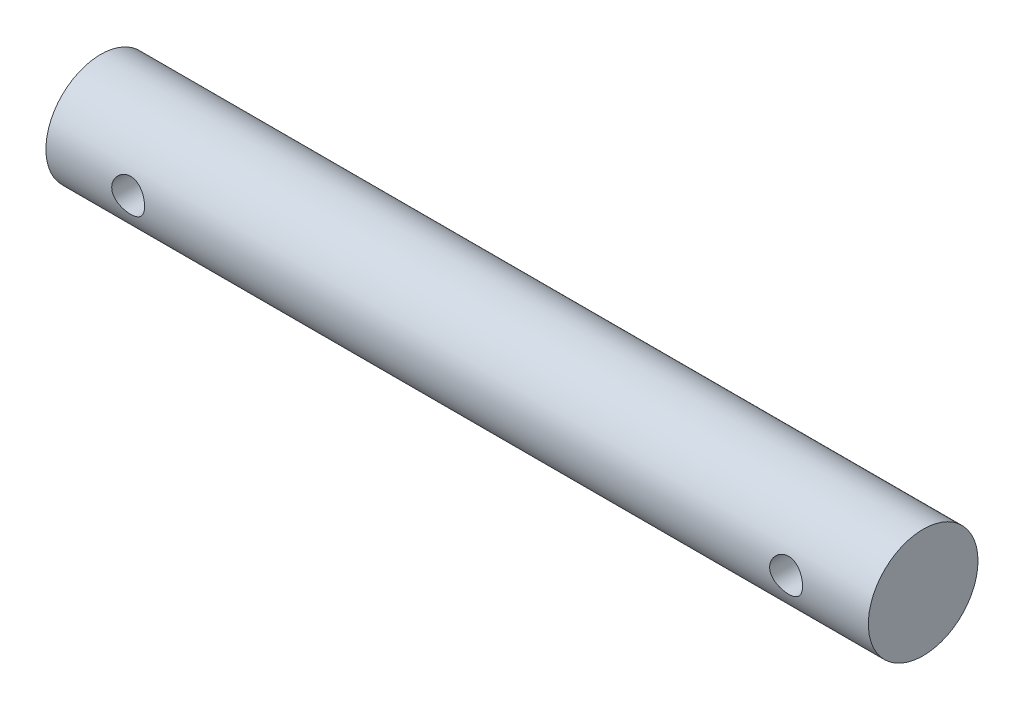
ISO-10303-21;
HEADER;
FILE_DESCRIPTION(('STEP AP214'),'2;1');
FILE_NAME('part.step','',(''),(''),'','','');
FILE_SCHEMA(('AUTOMOTIVE_DESIGN { 1 0 10303 214 1 1 1 1 }'));
ENDSEC;
DATA;
#1=APPLICATION_CONTEXT('core data for automotive mechanical design processes');
#2=APPLICATION_PROTOCOL_DEFINITION('international standard','automotive_design',2000,#1);
#3=PRODUCT_CONTEXT('',#1,'mechanical');
#4=PRODUCT('Part','Part','',(#3));
#5=PRODUCT_RELATED_PRODUCT_CATEGORY('part','',(#4));
#6=PRODUCT_DEFINITION_FORMATION('','',#4);
#7=PRODUCT_DEFINITION_CONTEXT('part definition',#1,'design');
#8=PRODUCT_DEFINITION('design','',#6,#7);
#9=PRODUCT_DEFINITION_SHAPE('','',#8);
#10=(LENGTH_UNIT() NAMED_UNIT(*) SI_UNIT(.MILLI.,.METRE.));
#11=(NAMED_UNIT(*) PLANE_ANGLE_UNIT() SI_UNIT($,.RADIAN.));
#12=(NAMED_UNIT(*) SI_UNIT($,.STERADIAN.) SOLID_ANGLE_UNIT());
#13=UNCERTAINTY_MEASURE_WITH_UNIT(LENGTH_MEASURE(1.E-05),#10,'distance_accuracy_value','');
#14=(GEOMETRIC_REPRESENTATION_CONTEXT(3) GLOBAL_UNCERTAINTY_ASSIGNED_CONTEXT((#13)) GLOBAL_UNIT_ASSIGNED_CONTEXT((#10,
#11,#12)) REPRESENTATION_CONTEXT('',''));
#15=CARTESIAN_POINT('',(0.,0.,0.));
#16=DIRECTION('',(0.,0.,1.));
#17=DIRECTION('',(1.,0.,0.));
#18=AXIS2_PLACEMENT_3D('',#15,#16,#17);
#19=CARTESIAN_POINT('',(150.,0.,0.));
#20=DIRECTION('',(-1.,0.,0.));
#21=DIRECTION('',(0.,0.,1.));
#22=AXIS2_PLACEMENT_3D('',#19,#20,#21);
#23=CYLINDRICAL_SURFACE('',#22,20.);
#24=CARTESIAN_POINT('',(-114.,0.,20.));
#25=CARTESIAN_POINT('',(-113.999989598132,-0.164652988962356,20.0000061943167));
#26=CARTESIAN_POINT('',(-114.006780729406,-0.329207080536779,19.9979626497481));
#27=CARTESIAN_POINT('',(-114.03382200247,-0.657107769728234,19.9898752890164));
#28=CARTESIAN_POINT('',(-114.054072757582,-0.820454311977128,19.983831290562));
#29=CARTESIAN_POINT('',(-114.134886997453,-1.30698999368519,19.959876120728));
#30=CARTESIAN_POINT('',(-114.215512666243,-1.62688975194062,19.9361415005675));
#31=CARTESIAN_POINT('',(-114.374154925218,-2.09209536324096,19.890895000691));
#32=CARTESIAN_POINT('',(-114.433302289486,-2.24469091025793,19.8742101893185));
#33=CARTESIAN_POINT('',(-114.563709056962,-2.5442798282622,19.8380770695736));
#34=CARTESIAN_POINT('',(-114.634964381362,-2.691275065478,19.8186296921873));
#35=CARTESIAN_POINT('',(-114.789092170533,-2.97877080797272,19.7774632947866));
#36=CARTESIAN_POINT('',(-114.871969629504,-3.11926848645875,19.755743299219));
#37=CARTESIAN_POINT('',(-115.048710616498,-3.39282129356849,19.7106054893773));
#38=CARTESIAN_POINT('',(-115.142570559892,-3.52587882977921,19.6871882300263));
#39=CARTESIAN_POINT('',(-115.343279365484,-3.78718937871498,19.6386181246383));
#40=CARTESIAN_POINT('',(-115.450404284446,-3.91522491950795,19.6134358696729));
#41=CARTESIAN_POINT('',(-115.674851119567,-4.16183570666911,19.5625911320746));
#42=CARTESIAN_POINT('',(-115.79216957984,-4.28041413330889,19.5369288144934));
#43=CARTESIAN_POINT('',(-116.036356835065,-4.50747636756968,19.4857950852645));
#44=CARTESIAN_POINT('',(-116.163230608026,-4.615954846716,19.4603237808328));
#45=CARTESIAN_POINT('',(-116.425636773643,-4.82200644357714,19.4102934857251));
#46=CARTESIAN_POINT('',(-116.561165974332,-4.91958354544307,19.3857341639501));
#47=CARTESIAN_POINT('',(-116.843287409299,-5.10532440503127,19.3376596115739));
#48=CARTESIAN_POINT('',(-116.990062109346,-5.19322086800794,19.3141812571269));
#49=CARTESIAN_POINT('',(-117.290805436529,-5.35625892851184,19.2696038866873));
#50=CARTESIAN_POINT('',(-117.444771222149,-5.43140551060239,19.2485039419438));
#51=CARTESIAN_POINT('',(-117.758929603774,-5.56839058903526,19.2093234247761));
#52=CARTESIAN_POINT('',(-117.919123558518,-5.63022616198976,19.1912435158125));
#53=CARTESIAN_POINT('',(-118.244487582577,-5.74000341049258,19.1586962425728));
#54=CARTESIAN_POINT('',(-118.409655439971,-5.78795116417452,19.1442272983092));
#55=CARTESIAN_POINT('',(-118.739174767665,-5.86841419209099,19.1197132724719));
#56=CARTESIAN_POINT('',(-118.903422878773,-5.90131899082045,19.1095570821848));
#57=CARTESIAN_POINT('',(-119.234233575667,-5.95328671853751,19.0934313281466));
#58=CARTESIAN_POINT('',(-119.400795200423,-5.97235522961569,19.0874600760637));
#59=CARTESIAN_POINT('',(-119.735026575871,-5.99648748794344,19.0798925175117));
#60=CARTESIAN_POINT('',(-119.902696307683,-6.0015514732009,19.0782961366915));
#61=CARTESIAN_POINT('',(-120.237852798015,-5.99762541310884,19.0795307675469));
#62=CARTESIAN_POINT('',(-120.405339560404,-5.98863567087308,19.0823616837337));
#63=CARTESIAN_POINT('',(-120.732778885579,-5.95727255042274,19.0921753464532));
#64=CARTESIAN_POINT('',(-120.89278410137,-5.93539727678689,19.0990035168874));
#65=CARTESIAN_POINT('',(-121.210363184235,-5.87886408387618,19.1164806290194));
#66=CARTESIAN_POINT('',(-121.367936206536,-5.84420182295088,19.1271308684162));
#67=CARTESIAN_POINT('',(-121.679475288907,-5.76240333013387,19.151932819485));
#68=CARTESIAN_POINT('',(-121.833442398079,-5.71527077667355,19.166083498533));
#69=CARTESIAN_POINT('',(-122.136866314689,-5.60889138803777,19.197484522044));
#70=CARTESIAN_POINT('',(-122.286321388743,-5.54963996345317,19.2147360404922));
#71=CARTESIAN_POINT('',(-122.581688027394,-5.41860914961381,19.2521004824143));
#72=CARTESIAN_POINT('',(-122.727525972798,-5.34667354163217,19.2722484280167));
#73=CARTESIAN_POINT('',(-123.012672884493,-5.19135839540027,19.3146649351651));
#74=CARTESIAN_POINT('',(-123.151979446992,-5.10797468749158,19.3369342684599));
#75=CARTESIAN_POINT('',(-123.558767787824,-4.84149472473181,19.4060193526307));
#76=CARTESIAN_POINT('',(-123.815349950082,-4.64196639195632,19.4551429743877));
#77=CARTESIAN_POINT('',(-124.302790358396,-4.19522722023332,19.5564461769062));
#78=CARTESIAN_POINT('',(-124.532126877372,-3.94637308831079,19.6086677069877));
#79=CARTESIAN_POINT('',(-124.946203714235,-3.41305957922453,19.708488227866));
#80=CARTESIAN_POINT('',(-125.130941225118,-3.12859796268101,19.7560869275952));
#81=CARTESIAN_POINT('',(-125.451443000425,-2.5294183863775,19.8417268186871));
#82=CARTESIAN_POINT('',(-125.586870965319,-2.21451053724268,19.8797018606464));
#83=CARTESIAN_POINT('',(-125.802397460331,-1.56498212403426,19.9413407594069));
#84=CARTESIAN_POINT('',(-125.882511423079,-1.23036708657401,19.9650086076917));
#85=CARTESIAN_POINT('',(-125.982608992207,-0.563808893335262,19.9947346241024));
#86=CARTESIAN_POINT('',(-126.004646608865,-0.232200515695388,20.001394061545));
#87=CARTESIAN_POINT('',(-125.993723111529,0.429998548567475,19.998116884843));
#88=CARTESIAN_POINT('',(-125.96076933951,0.760589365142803,19.9881824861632));
#89=CARTESIAN_POINT('',(-125.842462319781,1.40361385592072,19.9532280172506));
#90=CARTESIAN_POINT('',(-125.758309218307,1.71628897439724,19.928553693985));
#91=CARTESIAN_POINT('',(-125.541424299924,2.32302067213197,19.8669734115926));
#92=CARTESIAN_POINT('',(-125.408686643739,2.61707500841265,19.8300659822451));
#93=CARTESIAN_POINT('',(-125.094997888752,3.18574067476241,19.7467880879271));
#94=CARTESIAN_POINT('',(-124.913002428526,3.45974481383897,19.7002184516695));
#95=CARTESIAN_POINT('',(-124.507061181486,3.97412373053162,19.6029315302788));
#96=CARTESIAN_POINT('',(-124.283104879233,4.21449005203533,19.5522132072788));
#97=CARTESIAN_POINT('',(-123.915792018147,4.54922702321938,19.4760967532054));
#98=CARTESIAN_POINT('',(-123.78552078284,4.6581855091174,19.45026064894));
#99=CARTESIAN_POINT('',(-123.516101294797,4.8647507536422,19.3996259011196));
#100=CARTESIAN_POINT('',(-123.376956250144,4.96236157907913,19.3748268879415));
#101=CARTESIAN_POINT('',(-123.090620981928,5.14557811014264,19.3269761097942));
#102=CARTESIAN_POINT('',(-122.943427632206,5.23117910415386,19.3039250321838));
#103=CARTESIAN_POINT('',(-122.6420678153,5.38966081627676,19.2602780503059));
#104=CARTESIAN_POINT('',(-122.487904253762,5.46254677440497,19.2396811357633));
#105=CARTESIAN_POINT('',(-122.17427698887,5.59476151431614,19.2016499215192));
#106=CARTESIAN_POINT('',(-122.014838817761,5.65414703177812,19.1842024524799));
#107=CARTESIAN_POINT('',(-121.691232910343,5.75922373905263,19.1529201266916));
#108=CARTESIAN_POINT('',(-121.527067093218,5.80492040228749,19.1390838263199));
#109=CARTESIAN_POINT('',(-121.19517685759,5.88222586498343,19.1154663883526));
#110=CARTESIAN_POINT('',(-121.0274527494,5.91383588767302,19.1056848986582));
#111=CARTESIAN_POINT('',(-120.689728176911,5.96266568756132,19.0905022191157));
#112=CARTESIAN_POINT('',(-120.519727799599,5.97988601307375,19.0851008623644));
#113=CARTESIAN_POINT('',(-120.18594068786,5.99934947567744,19.0789911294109));
#114=CARTESIAN_POINT('',(-120.022191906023,6.00218967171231,19.07809567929));
#115=CARTESIAN_POINT('',(-119.694983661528,5.99447696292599,19.0805205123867));
#116=CARTESIAN_POINT('',(-119.531524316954,5.98391947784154,19.0838422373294));
#117=CARTESIAN_POINT('',(-119.206219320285,5.94950873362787,19.0945978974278));
#118=CARTESIAN_POINT('',(-119.044373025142,5.9256610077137,19.1020301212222));
#119=CARTESIAN_POINT('',(-118.723324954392,5.86487874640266,19.120779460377));
#120=CARTESIAN_POINT('',(-118.564124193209,5.82793930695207,19.1320980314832));
#121=CARTESIAN_POINT('',(-118.251557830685,5.74185426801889,19.1581079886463));
#122=CARTESIAN_POINT('',(-118.098143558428,5.69287144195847,19.1727542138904));
#123=CARTESIAN_POINT('',(-117.795973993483,5.58284269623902,19.205081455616));
#124=CARTESIAN_POINT('',(-117.647220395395,5.52179244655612,19.2227635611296));
#125=CARTESIAN_POINT('',(-117.355387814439,5.38811476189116,19.2606604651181));
#126=CARTESIAN_POINT('',(-117.212307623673,5.31548980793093,19.2808747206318));
#127=CARTESIAN_POINT('',(-116.932591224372,5.15913622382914,19.3232987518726));
#128=CARTESIAN_POINT('',(-116.795957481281,5.0754033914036,19.3455092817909));
#129=CARTESIAN_POINT('',(-116.52518154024,4.89419285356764,19.3921618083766));
#130=CARTESIAN_POINT('',(-116.391307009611,4.79632829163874,19.4166553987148));
#131=CARTESIAN_POINT('',(-116.132158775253,4.58990823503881,19.4664844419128));
#132=CARTESIAN_POINT('',(-116.00688830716,4.48134875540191,19.4918202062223));
#133=CARTESIAN_POINT('',(-115.76578299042,4.25427156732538,19.5426381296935));
#134=CARTESIAN_POINT('',(-115.649947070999,4.13575499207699,19.5681202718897));
#135=CARTESIAN_POINT('',(-115.428381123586,3.88944109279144,19.6185640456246));
#136=CARTESIAN_POINT('',(-115.322654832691,3.76164036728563,19.6435254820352));
#137=CARTESIAN_POINT('',(-115.119121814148,3.49372933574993,19.6929668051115));
#138=CARTESIAN_POINT('',(-115.021635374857,3.3533689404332,19.7174114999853));
#139=CARTESIAN_POINT('',(-114.838859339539,3.06460835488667,19.7643509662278));
#140=CARTESIAN_POINT('',(-114.75356970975,2.91620818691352,19.7868457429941));
#141=CARTESIAN_POINT('',(-114.5958808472,2.61242605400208,19.8292394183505));
#142=CARTESIAN_POINT('',(-114.523476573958,2.45704684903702,19.8491393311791));
#143=CARTESIAN_POINT('',(-114.392122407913,2.14034959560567,19.8857816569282));
#144=CARTESIAN_POINT('',(-114.333171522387,1.97903198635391,19.902524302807));
#145=CARTESIAN_POINT('',(-114.234824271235,1.66920359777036,19.9307619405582));
#146=CARTESIAN_POINT('',(-114.194008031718,1.52117718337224,19.9426273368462));
#147=CARTESIAN_POINT('',(-114.123795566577,1.22223078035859,19.963183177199));
#148=CARTESIAN_POINT('',(-114.094402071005,1.07131010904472,19.9718728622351));
#149=CARTESIAN_POINT('',(-114.023783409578,0.615632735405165,19.9928210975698));
#150=CARTESIAN_POINT('',(-114.000019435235,0.307643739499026,19.9999884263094));
#151=CARTESIAN_POINT('',(-114.,0.,20.));
#152=B_SPLINE_CURVE_WITH_KNOTS('',3,(#24,#25,#26,#27,#28,#29,#30,#31,#32,#33,#34,#35,#36,#37,
#38,#39,#40,#41,#42,#43,#44,#45,#46,#47,#48,#49,#50,#51,#52,#53,#54,#55,#56,#57,#58,#59,#60,#61,
#62,#63,#64,#65,#66,#67,#68,#69,#70,#71,#72,#73,#74,#75,#76,#77,#78,#79,#80,#81,#82,#83,#84,#85,
#86,#87,#88,#89,#90,#91,#92,#93,#94,#95,#96,#97,#98,#99,#100,#101,#102,#103,#104,#105,#106,#107,
#108,#109,#110,#111,#112,#113,#114,#115,#116,#117,#118,#119,#120,#121,#122,#123,#124,#125,#126,
#127,#128,#129,#130,#131,#132,#133,#134,#135,#136,#137,#138,#139,#140,#141,#142,#143,#144,#145,
#146,#147,#148,#149,#150,#151),.UNSPECIFIED.,.T.,.F.,(4,2,2,2,2,2,2,2,2,2,2,2,2,2,2,2,2,2,2,2,2,
2,2,2,2,2,2,2,2,2,2,2,2,2,2,2,2,2,2,2,2,2,2,2,2,2,2,2,2,2,2,2,2,2,2,2,2,2,2,2,2,2,2,4),(0.,
0.493608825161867,0.987240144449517,1.97386718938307,2.46696137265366,2.95988977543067,
3.45303064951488,3.94601101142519,4.45191823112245,4.95765459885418,5.46365628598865,
5.96947243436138,6.48689212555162,7.00410906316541,7.52143947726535,8.03854313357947,
8.54137016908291,9.04399423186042,9.54660975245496,10.0492144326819,10.5335590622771,
11.0180682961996,11.5024347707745,11.9869850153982,12.4779832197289,12.9691607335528,
13.9507580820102,14.9733478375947,15.9960019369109,17.0255055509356,18.0547218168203,
19.0470160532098,20.0391778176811,21.0089335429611,21.9788058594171,22.9711159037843,
23.9636749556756,24.4785258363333,24.9931916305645,25.5080587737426,26.0227132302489,
26.535163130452,27.0474078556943,27.5596080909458,28.0717888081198,28.5625187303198,
29.0534164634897,29.5441099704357,30.0349874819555,30.5195637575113,31.0043142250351,
31.4889609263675,31.9737915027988,32.476111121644,32.9786186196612,33.4810690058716,
33.983704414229,34.500977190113,35.0182485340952,35.5353170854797,36.052347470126,
36.5138710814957,36.9755049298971,37.8977819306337),.UNSPECIFIED.);
#153=CARTESIAN_POINT('',(-114.,0.,20.));
#154=VERTEX_POINT('',#153);
#155=EDGE_CURVE('E10',#154,#154,#152,.T.);
#156=ORIENTED_EDGE('',*,*,#155,.T.);
#157=EDGE_LOOP('',(#156));
#158=FACE_BOUND('',#157,.T.);
#159=CARTESIAN_POINT('',(-120.,6.00000000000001,-19.0787840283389));
#160=CARTESIAN_POINT('',(-120.164395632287,5.99999967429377,-19.0787842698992));
#161=CARTESIAN_POINT('',(-120.328796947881,5.9932378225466,-19.0809146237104));
#162=CARTESIAN_POINT('',(-120.656385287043,5.96625280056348,-19.0893694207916));
#163=CARTESIAN_POINT('',(-120.819572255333,5.94602902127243,-19.0956940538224));
#164=CARTESIAN_POINT('',(-121.143555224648,5.89230407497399,-19.1123400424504));
#165=CARTESIAN_POINT('',(-121.304350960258,5.85880144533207,-19.1226618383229));
#166=CARTESIAN_POINT('',(-121.622448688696,5.77880328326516,-19.1469887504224));
#167=CARTESIAN_POINT('',(-121.779749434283,5.73230319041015,-19.1609951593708));
#168=CARTESIAN_POINT('',(-122.089433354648,5.62680877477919,-19.1922390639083));
#169=CARTESIAN_POINT('',(-122.241825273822,5.56783826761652,-19.2094703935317));
#170=CARTESIAN_POINT('',(-122.541017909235,5.43781532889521,-19.2466811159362));
#171=CARTESIAN_POINT('',(-122.687818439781,5.3667624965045,-19.2666605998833));
#172=CARTESIAN_POINT('',(-122.974945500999,5.2130817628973,-19.3088095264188));
#173=CARTESIAN_POINT('',(-123.115270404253,5.13045097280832,-19.3309795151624));
#174=CARTESIAN_POINT('',(-123.38852055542,4.95422567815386,-19.3768917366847));
#175=CARTESIAN_POINT('',(-123.52144802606,4.86063449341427,-19.400633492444));
#176=CARTESIAN_POINT('',(-123.782911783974,4.66020317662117,-19.4497675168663));
#177=CARTESIAN_POINT('',(-123.911208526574,4.5530572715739,-19.4751876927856));
#178=CARTESIAN_POINT('',(-124.15834547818,4.32851343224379,-19.5263212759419));
#179=CARTESIAN_POINT('',(-124.277188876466,4.21111898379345,-19.5520345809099));
#180=CARTESIAN_POINT('',(-124.50477310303,3.96672570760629,-19.6030781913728));
#181=CARTESIAN_POINT('',(-124.613508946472,3.83972219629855,-19.6284083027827));
#182=CARTESIAN_POINT('',(-124.820058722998,3.57700221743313,-19.6779804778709));
#183=CARTESIAN_POINT('',(-124.917876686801,3.44128899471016,-19.7022229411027));
#184=CARTESIAN_POINT('',(-125.10390875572,3.15900107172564,-19.7494713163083));
#185=CARTESIAN_POINT('',(-125.191876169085,3.01225742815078,-19.7724402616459));
#186=CARTESIAN_POINT('',(-125.355058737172,2.71156682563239,-19.8159145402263));
#187=CARTESIAN_POINT('',(-125.430278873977,2.55762271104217,-19.8364208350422));
#188=CARTESIAN_POINT('',(-125.567409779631,2.24350676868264,-19.874398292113));
#189=CARTESIAN_POINT('',(-125.629317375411,2.08333346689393,-19.8918687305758));
#190=CARTESIAN_POINT('',(-125.739235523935,1.75802110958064,-19.923253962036));
#191=CARTESIAN_POINT('',(-125.787252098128,1.59288424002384,-19.9371702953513));
#192=CARTESIAN_POINT('',(-125.867825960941,1.2635434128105,-19.9607098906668));
#193=CARTESIAN_POINT('',(-125.90078131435,1.09944466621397,-19.9704432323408));
#194=CARTESIAN_POINT('',(-125.952872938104,0.768945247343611,-19.985896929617));
#195=CARTESIAN_POINT('',(-125.972014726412,0.602545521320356,-19.9916188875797));
#196=CARTESIAN_POINT('',(-125.996320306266,0.268635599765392,-19.9988930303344));
#197=CARTESIAN_POINT('',(-126.001483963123,0.101125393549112,-20.0004451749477));
#198=CARTESIAN_POINT('',(-125.997783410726,-0.233724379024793,-19.9993350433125));
#199=CARTESIAN_POINT('',(-125.988919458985,-0.40106394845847,-19.9966728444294));
#200=CARTESIAN_POINT('',(-125.957757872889,-0.728949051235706,-19.9873627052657));
#201=CARTESIAN_POINT('',(-125.935900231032,-0.889540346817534,-19.9808453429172));
#202=CARTESIAN_POINT('',(-125.8793052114,-1.20829671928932,-19.9641052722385));
#203=CARTESIAN_POINT('',(-125.844563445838,-1.36646095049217,-19.9538813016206));
#204=CARTESIAN_POINT('',(-125.762508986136,-1.67917027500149,-19.9300017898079));
#205=CARTESIAN_POINT('',(-125.715200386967,-1.83371652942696,-19.9163473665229));
#206=CARTESIAN_POINT('',(-125.608370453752,-2.13827836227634,-19.8859547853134));
#207=CARTESIAN_POINT('',(-125.548844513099,-2.28829220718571,-19.8692154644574));
#208=CARTESIAN_POINT('',(-125.417310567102,-2.58443249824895,-19.8328821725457));
#209=CARTESIAN_POINT('',(-125.345169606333,-2.73049618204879,-19.8132581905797));
#210=CARTESIAN_POINT('',(-125.189380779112,-3.01608960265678,-19.7717989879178));
#211=CARTESIAN_POINT('',(-125.105728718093,-3.15561693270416,-19.7499629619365));
#212=CARTESIAN_POINT('',(-124.927531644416,-3.42721577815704,-19.7046478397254));
#213=CARTESIAN_POINT('',(-124.832988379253,-3.5592884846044,-19.6811690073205));
#214=CARTESIAN_POINT('',(-124.633579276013,-3.81526891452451,-19.6331528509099));
#215=CARTESIAN_POINT('',(-124.528709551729,-3.93917353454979,-19.6086151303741));
#216=CARTESIAN_POINT('',(-124.30513036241,-4.18260648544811,-19.5581655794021));
#217=CARTESIAN_POINT('',(-124.186045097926,-4.30178647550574,-19.5322370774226));
#218=CARTESIAN_POINT('',(-123.938205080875,-4.52977958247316,-19.4806254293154));
#219=CARTESIAN_POINT('',(-123.809446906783,-4.63858899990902,-19.4549423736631));
#220=CARTESIAN_POINT('',(-123.543118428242,-4.84506973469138,-19.404550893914));
#221=CARTESIAN_POINT('',(-123.405548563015,-4.94274160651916,-19.3798424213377));
#222=CARTESIAN_POINT('',(-123.122466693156,-5.12627109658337,-19.3321064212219));
#223=CARTESIAN_POINT('',(-122.976954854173,-5.21212896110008,-19.309078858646));
#224=CARTESIAN_POINT('',(-122.677459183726,-5.37218039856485,-19.2651663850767));
#225=CARTESIAN_POINT('',(-122.523406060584,-5.44625084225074,-19.24430479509));
#226=CARTESIAN_POINT('',(-122.209269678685,-5.58106888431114,-19.2056395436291));
#227=CARTESIAN_POINT('',(-122.049188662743,-5.64182138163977,-19.1878347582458));
#228=CARTESIAN_POINT('',(-121.724100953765,-5.74950362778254,-19.1558441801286));
#229=CARTESIAN_POINT('',(-121.559094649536,-5.79643446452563,-19.1416581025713));
#230=CARTESIAN_POINT('',(-121.225384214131,-5.87604074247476,-19.1173711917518));
#231=CARTESIAN_POINT('',(-121.056680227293,-5.90871673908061,-19.1072701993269));
#232=CARTESIAN_POINT('',(-120.72325820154,-5.9585432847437,-19.0917892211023));
#233=CARTESIAN_POINT('',(-120.558627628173,-5.97622963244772,-19.0862465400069));
#234=CARTESIAN_POINT('',(-120.228319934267,-5.99793896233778,-19.0794355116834));
#235=CARTESIAN_POINT('',(-120.062642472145,-6.00195722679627,-19.0781686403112));
#236=CARTESIAN_POINT('',(-119.731629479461,-5.99627914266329,-19.0799540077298));
#237=CARTESIAN_POINT('',(-119.566293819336,-5.98658965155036,-19.0830040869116));
#238=CARTESIAN_POINT('',(-119.237061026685,-5.95359629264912,-19.0933231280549));
#239=CARTESIAN_POINT('',(-119.073164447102,-5.93028740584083,-19.1005936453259));
#240=CARTESIAN_POINT('',(-118.752364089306,-5.87105546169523,-19.1188818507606));
#241=CARTESIAN_POINT('',(-118.595389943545,-5.83548177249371,-19.1297955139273));
#242=CARTESIAN_POINT('',(-118.285042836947,-5.75193814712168,-19.155080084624));
#243=CARTESIAN_POINT('',(-118.131671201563,-5.70396372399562,-19.1694522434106));
#244=CARTESIAN_POINT('',(-117.678568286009,-5.54198566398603,-19.2171590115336));
#245=CARTESIAN_POINT('',(-117.385565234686,-5.4098743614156,-19.2551012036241));
#246=CARTESIAN_POINT('',(-116.817888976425,-5.09727284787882,-19.3402336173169));
#247=CARTESIAN_POINT('',(-116.543918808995,-4.9155793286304,-19.3876447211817));
#248=CARTESIAN_POINT('',(-116.0294298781,-4.51017529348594,-19.4859343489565));
#249=CARTESIAN_POINT('',(-115.788919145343,-4.28645472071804,-19.536813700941));
#250=CARTESIAN_POINT('',(-115.453734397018,-3.91924095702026,-19.6126500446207));
#251=CARTESIAN_POINT('',(-115.344521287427,-3.78886107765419,-19.6383140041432));
#252=CARTESIAN_POINT('',(-115.137460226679,-3.51917040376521,-19.688428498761));
#253=CARTESIAN_POINT('',(-115.039608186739,-3.37986285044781,-19.7128794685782));
#254=CARTESIAN_POINT('',(-114.855939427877,-3.09316132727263,-19.7598954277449));
#255=CARTESIAN_POINT('',(-114.770127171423,-2.94576438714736,-19.7824597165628));
#256=CARTESIAN_POINT('',(-114.611262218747,-2.64396805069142,-19.8250508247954));
#257=CARTESIAN_POINT('',(-114.53820425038,-2.48957158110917,-19.8450786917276));
#258=CARTESIAN_POINT('',(-114.405887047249,-2.17592777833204,-19.8819035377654));
#259=CARTESIAN_POINT('',(-114.34653209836,-2.01672345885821,-19.898722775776));
#260=CARTESIAN_POINT('',(-114.241481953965,-1.69361031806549,-19.9288232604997));
#261=CARTESIAN_POINT('',(-114.195781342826,-1.5297033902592,-19.9421059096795));
#262=CARTESIAN_POINT('',(-114.118426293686,-1.19834661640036,-19.9647574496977));
#263=CARTESIAN_POINT('',(-114.086771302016,-1.03089691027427,-19.9741264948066));
#264=CARTESIAN_POINT('',(-114.037806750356,-0.693734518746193,-19.9886767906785));
#265=CARTESIAN_POINT('',(-114.020496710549,-0.524021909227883,-19.993858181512));
#266=CARTESIAN_POINT('',(-114.000778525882,-0.190258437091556,-19.9997643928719));
#267=CARTESIAN_POINT('',(-113.997819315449,-0.0262428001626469,-20.0006540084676));
#268=CARTESIAN_POINT('',(-114.005338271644,0.301510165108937,-19.9983988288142));
#269=CARTESIAN_POINT('',(-114.015821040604,0.465247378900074,-19.9952526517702));
#270=CARTESIAN_POINT('',(-114.05012928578,0.791119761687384,-19.9850117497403));
#271=CARTESIAN_POINT('',(-114.073949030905,0.953255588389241,-19.9779187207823));
#272=CARTESIAN_POINT('',(-114.134726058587,1.27489540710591,-19.9599748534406));
#273=CARTESIAN_POINT('',(-114.171688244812,1.43439839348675,-19.94912261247));
#274=CARTESIAN_POINT('',(-114.257945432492,1.74783768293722,-19.9240936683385));
#275=CARTESIAN_POINT('',(-114.307098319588,1.90181622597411,-19.909955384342));
#276=CARTESIAN_POINT('',(-114.417561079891,2.20509189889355,-19.8786523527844));
#277=CARTESIAN_POINT('',(-114.478875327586,2.35438732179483,-19.8614865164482));
#278=CARTESIAN_POINT('',(-114.613166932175,2.64725820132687,-19.8245757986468));
#279=CARTESIAN_POINT('',(-114.68614149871,2.79083501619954,-19.8048315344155));
#280=CARTESIAN_POINT('',(-114.843270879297,3.07148490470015,-19.7632516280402));
#281=CARTESIAN_POINT('',(-114.927429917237,3.20855549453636,-19.7414151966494));
#282=CARTESIAN_POINT('',(-115.109174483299,3.47955140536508,-19.6954868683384));
#283=CARTESIAN_POINT('',(-115.207100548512,3.61324002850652,-19.6713454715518));
#284=CARTESIAN_POINT('',(-115.413604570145,3.87200061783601,-19.6220531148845));
#285=CARTESIAN_POINT('',(-115.522186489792,3.99706934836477,-19.5969017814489));
#286=CARTESIAN_POINT('',(-115.749265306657,4.23776193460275,-19.5462656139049));
#287=CARTESIAN_POINT('',(-115.867761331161,4.35338661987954,-19.5207808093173));
#288=CARTESIAN_POINT('',(-116.113985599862,4.5745256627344,-19.4701461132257));
#289=CARTESIAN_POINT('',(-116.241717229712,4.68003627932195,-19.444996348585));
#290=CARTESIAN_POINT('',(-116.50951602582,4.8831956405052,-19.3949908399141));
#291=CARTESIAN_POINT('',(-116.649836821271,4.98051801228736,-19.3701659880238));
#292=CARTESIAN_POINT('',(-116.938488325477,5.16297377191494,-19.3223342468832));
#293=CARTESIAN_POINT('',(-117.086819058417,5.24810712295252,-19.2993273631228));
#294=CARTESIAN_POINT('',(-117.390442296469,5.40550061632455,-19.2558362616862));
#295=CARTESIAN_POINT('',(-117.545732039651,5.47776581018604,-19.2353510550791));
#296=CARTESIAN_POINT('',(-117.862245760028,5.60886271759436,-19.197534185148));
#297=CARTESIAN_POINT('',(-118.023469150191,5.66769575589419,-19.1802022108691));
#298=CARTESIAN_POINT('',(-118.333012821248,5.76581282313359,-19.1509198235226));
#299=CARTESIAN_POINT('',(-118.480847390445,5.80652152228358,-19.1385904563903));
#300=CARTESIAN_POINT('',(-118.779418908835,5.87653712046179,-19.1172083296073));
#301=CARTESIAN_POINT('',(-118.930155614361,5.90584497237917,-19.1081552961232));
#302=CARTESIAN_POINT('',(-119.233600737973,5.95283156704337,-19.0935696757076));
#303=CARTESIAN_POINT('',(-119.386309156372,5.97051030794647,-19.0880370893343));
#304=CARTESIAN_POINT('',(-119.692676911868,5.99409304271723,-19.0806446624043));
#305=CARTESIAN_POINT('',(-119.846335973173,6.00000030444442,-19.0787838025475));
#306=CARTESIAN_POINT('',(-120.,6.00000000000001,-19.0787840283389));
#307=B_SPLINE_CURVE_WITH_KNOTS('',3,(#159,#160,#161,#162,#163,#164,#165,#166,#167,#168,#169,
#170,#171,#172,#173,#174,#175,#176,#177,#178,#179,#180,#181,#182,#183,#184,#185,#186,#187,#188,
#189,#190,#191,#192,#193,#194,#195,#196,#197,#198,#199,#200,#201,#202,#203,#204,#205,#206,#207,
#208,#209,#210,#211,#212,#213,#214,#215,#216,#217,#218,#219,#220,#221,#222,#223,#224,#225,#226,
#227,#228,#229,#230,#231,#232,#233,#234,#235,#236,#237,#238,#239,#240,#241,#242,#243,#244,#245,
#246,#247,#248,#249,#250,#251,#252,#253,#254,#255,#256,#257,#258,#259,#260,#261,#262,#263,#264,
#265,#266,#267,#268,#269,#270,#271,#272,#273,#274,#275,#276,#277,#278,#279,#280,#281,#282,#283,
#284,#285,#286,#287,#288,#289,#290,#291,#292,#293,#294,#295,#296,#297,#298,#299,#300,#301,#302,
#303,#304,#305,#306),.UNSPECIFIED.,.T.,.F.,(4,2,2,2,2,2,2,2,2,2,2,2,2,2,2,2,2,2,2,2,2,2,2,2,2,2,
2,2,2,2,2,2,2,2,2,2,2,2,2,2,2,2,2,2,2,2,2,2,2,2,2,2,2,2,2,2,2,2,2,2,2,2,2,2,2,2,2,2,2,2,2,2,2,
4),(0.,0.49304464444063,0.986111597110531,1.47923287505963,1.9725273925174,2.46488820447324,
2.9572653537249,3.44976557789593,3.94211701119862,4.44876324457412,4.95523781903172,
5.46196086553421,5.96849621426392,6.48573792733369,7.00277701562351,7.51993920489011,
8.03687687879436,8.53922484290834,9.04137202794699,9.54352405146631,10.0456668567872,
10.5317038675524,11.0179065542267,11.5039510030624,11.9901790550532,12.4818800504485,
12.9737606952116,13.4655625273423,13.9575501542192,14.4683445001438,14.9793203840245,
15.490270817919,16.0012105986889,16.5171795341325,17.0329583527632,17.5486965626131,
18.0644146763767,18.5608113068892,19.0573792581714,19.5536988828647,20.050201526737,
20.533592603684,21.0171588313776,21.9834342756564,22.9756443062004,23.9680920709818,
24.4835957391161,24.9989133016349,25.514421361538,26.029715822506,26.5412940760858,
27.0526691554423,27.5640240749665,28.0753618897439,28.5669000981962,29.0586066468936,
29.5501020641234,30.0417810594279,30.5279775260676,31.0143491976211,31.5006046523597,
31.9870442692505,32.4888732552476,32.9908895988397,33.4928617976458,33.995018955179,
34.5120832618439,35.0291491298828,35.5460115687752,36.0628230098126,36.5238485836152,
36.9848356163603,37.4458227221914,37.906681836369),.UNSPECIFIED.);
#308=CARTESIAN_POINT('',(-120.,6.00000000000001,-19.0787840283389));
#309=VERTEX_POINT('',#308);
#310=EDGE_CURVE('E44',#309,#309,#307,.T.);
#311=ORIENTED_EDGE('',*,*,#310,.T.);
#312=EDGE_LOOP('',(#311));
#313=FACE_BOUND('',#312,.T.);
#314=CARTESIAN_POINT('',(126.,0.,20.));
#315=CARTESIAN_POINT('',(126.000010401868,-0.164652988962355,20.0000061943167));
#316=CARTESIAN_POINT('',(125.993219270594,-0.329207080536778,19.9979626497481));
#317=CARTESIAN_POINT('',(125.96617799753,-0.657107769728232,19.9898752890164));
#318=CARTESIAN_POINT('',(125.945927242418,-0.820454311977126,19.983831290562));
#319=CARTESIAN_POINT('',(125.865113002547,-1.3069899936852,19.959876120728));
#320=CARTESIAN_POINT('',(125.784487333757,-1.62688975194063,19.9361415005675));
#321=CARTESIAN_POINT('',(125.625845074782,-2.09209536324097,19.890895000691));
#322=CARTESIAN_POINT('',(125.566697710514,-2.24469091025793,19.8742101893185));
#323=CARTESIAN_POINT('',(125.436290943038,-2.5442798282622,19.8380770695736));
#324=CARTESIAN_POINT('',(125.365035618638,-2.69127506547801,19.8186296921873));
#325=CARTESIAN_POINT('',(125.210907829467,-2.97877080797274,19.7774632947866));
#326=CARTESIAN_POINT('',(125.128030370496,-3.11926848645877,19.755743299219));
#327=CARTESIAN_POINT('',(124.951289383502,-3.39282129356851,19.7106054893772));
#328=CARTESIAN_POINT('',(124.857429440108,-3.52587882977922,19.6871882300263));
#329=CARTESIAN_POINT('',(124.656720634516,-3.78718937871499,19.6386181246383));
#330=CARTESIAN_POINT('',(124.549595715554,-3.91522491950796,19.6134358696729));
#331=CARTESIAN_POINT('',(124.325148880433,-4.16183570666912,19.5625911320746));
#332=CARTESIAN_POINT('',(124.20783042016,-4.2804141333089,19.5369288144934));
#333=CARTESIAN_POINT('',(123.963643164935,-4.5074763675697,19.4857950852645));
#334=CARTESIAN_POINT('',(123.836769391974,-4.61595484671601,19.4603237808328));
#335=CARTESIAN_POINT('',(123.574363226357,-4.82200644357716,19.4102934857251));
#336=CARTESIAN_POINT('',(123.438834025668,-4.91958354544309,19.3857341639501));
#337=CARTESIAN_POINT('',(123.156712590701,-5.10532440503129,19.3376596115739));
#338=CARTESIAN_POINT('',(123.009937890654,-5.19322086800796,19.3141812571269));
#339=CARTESIAN_POINT('',(122.709194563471,-5.35625892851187,19.2696038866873));
#340=CARTESIAN_POINT('',(122.555228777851,-5.43140551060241,19.2485039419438));
#341=CARTESIAN_POINT('',(122.241070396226,-5.56839058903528,19.2093234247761));
#342=CARTESIAN_POINT('',(122.080876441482,-5.63022616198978,19.1912435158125));
#343=CARTESIAN_POINT('',(121.755512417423,-5.7400034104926,19.1586962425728));
#344=CARTESIAN_POINT('',(121.59034456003,-5.78795116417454,19.1442272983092));
#345=CARTESIAN_POINT('',(121.260825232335,-5.86841419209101,19.1197132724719));
#346=CARTESIAN_POINT('',(121.096577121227,-5.90131899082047,19.1095570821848));
#347=CARTESIAN_POINT('',(120.765766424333,-5.95328671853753,19.0934313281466));
#348=CARTESIAN_POINT('',(120.599204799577,-5.97235522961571,19.0874600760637));
#349=CARTESIAN_POINT('',(120.264973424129,-5.99648748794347,19.0798925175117));
#350=CARTESIAN_POINT('',(120.097303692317,-6.00155147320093,19.0782961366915));
#351=CARTESIAN_POINT('',(119.762147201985,-5.99762541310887,19.0795307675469));
#352=CARTESIAN_POINT('',(119.594660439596,-5.98863567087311,19.0823616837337));
#353=CARTESIAN_POINT('',(119.267221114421,-5.95727255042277,19.0921753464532));
#354=CARTESIAN_POINT('',(119.10721589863,-5.93539727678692,19.0990035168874));
#355=CARTESIAN_POINT('',(118.789636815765,-5.87886408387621,19.1164806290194));
#356=CARTESIAN_POINT('',(118.632063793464,-5.84420182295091,19.1271308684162));
#357=CARTESIAN_POINT('',(118.320524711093,-5.7624033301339,19.151932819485));
#358=CARTESIAN_POINT('',(118.166557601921,-5.71527077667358,19.166083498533));
#359=CARTESIAN_POINT('',(117.863133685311,-5.6088913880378,19.197484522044));
#360=CARTESIAN_POINT('',(117.713678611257,-5.54963996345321,19.2147360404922));
#361=CARTESIAN_POINT('',(117.418311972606,-5.41860914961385,19.2521004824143));
#362=CARTESIAN_POINT('',(117.272474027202,-5.34667354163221,19.2722484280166));
#363=CARTESIAN_POINT('',(116.987327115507,-5.1913583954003,19.3146649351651));
#364=CARTESIAN_POINT('',(116.848020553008,-5.10797468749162,19.3369342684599));
#365=CARTESIAN_POINT('',(116.441232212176,-4.84149472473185,19.4060193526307));
#366=CARTESIAN_POINT('',(116.184650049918,-4.64196639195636,19.4551429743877));
#367=CARTESIAN_POINT('',(115.697209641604,-4.19522722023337,19.5564461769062));
#368=CARTESIAN_POINT('',(115.467873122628,-3.94637308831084,19.6086677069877));
#369=CARTESIAN_POINT('',(115.053796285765,-3.41305957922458,19.708488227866));
#370=CARTESIAN_POINT('',(114.869058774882,-3.12859796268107,19.7560869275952));
#371=CARTESIAN_POINT('',(114.548556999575,-2.52941838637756,19.8417268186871));
#372=CARTESIAN_POINT('',(114.413129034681,-2.21451053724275,19.8797018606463));
#373=CARTESIAN_POINT('',(114.197602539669,-1.56498212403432,19.9413407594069));
#374=CARTESIAN_POINT('',(114.117488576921,-1.23036708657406,19.9650086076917));
#375=CARTESIAN_POINT('',(114.017391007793,-0.563808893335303,19.9947346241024));
#376=CARTESIAN_POINT('',(113.995353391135,-0.232200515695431,20.001394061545));
#377=CARTESIAN_POINT('',(114.006276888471,0.429998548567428,19.998116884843));
#378=CARTESIAN_POINT('',(114.03923066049,0.760589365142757,19.9881824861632));
#379=CARTESIAN_POINT('',(114.157537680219,1.40361385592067,19.9532280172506));
#380=CARTESIAN_POINT('',(114.241690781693,1.71628897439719,19.928553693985));
#381=CARTESIAN_POINT('',(114.458575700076,2.32302067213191,19.8669734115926));
#382=CARTESIAN_POINT('',(114.591313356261,2.6170750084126,19.8300659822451));
#383=CARTESIAN_POINT('',(114.905002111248,3.18574067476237,19.7467880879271));
#384=CARTESIAN_POINT('',(115.086997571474,3.45974481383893,19.7002184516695));
#385=CARTESIAN_POINT('',(115.492938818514,3.97412373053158,19.6029315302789));
#386=CARTESIAN_POINT('',(115.716895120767,4.21449005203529,19.5522132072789));
#387=CARTESIAN_POINT('',(116.084207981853,4.54922702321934,19.4760967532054));
#388=CARTESIAN_POINT('',(116.21447921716,4.65818550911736,19.45026064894));
#389=CARTESIAN_POINT('',(116.483898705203,4.86475075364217,19.3996259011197));
#390=CARTESIAN_POINT('',(116.623043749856,4.9623615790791,19.3748268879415));
#391=CARTESIAN_POINT('',(116.909379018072,5.14557811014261,19.3269761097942));
#392=CARTESIAN_POINT('',(117.056572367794,5.23117910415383,19.3039250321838));
#393=CARTESIAN_POINT('',(117.3579321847,5.38966081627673,19.2602780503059));
#394=CARTESIAN_POINT('',(117.512095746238,5.46254677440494,19.2396811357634));
#395=CARTESIAN_POINT('',(117.82572301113,5.5947615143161,19.2016499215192));
#396=CARTESIAN_POINT('',(117.985161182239,5.65414703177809,19.1842024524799));
#397=CARTESIAN_POINT('',(118.308767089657,5.7592237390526,19.1529201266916));
#398=CARTESIAN_POINT('',(118.472932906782,5.80492040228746,19.1390838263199));
#399=CARTESIAN_POINT('',(118.80482314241,5.8822258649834,19.1154663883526));
#400=CARTESIAN_POINT('',(118.9725472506,5.91383588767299,19.1056848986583));
#401=CARTESIAN_POINT('',(119.310271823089,5.96266568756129,19.0905022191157));
#402=CARTESIAN_POINT('',(119.480272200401,5.97988601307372,19.0851008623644));
#403=CARTESIAN_POINT('',(119.81405931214,5.99934947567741,19.0789911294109));
#404=CARTESIAN_POINT('',(119.977808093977,6.00218967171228,19.07809567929));
#405=CARTESIAN_POINT('',(120.305016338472,5.99447696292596,19.0805205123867));
#406=CARTESIAN_POINT('',(120.468475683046,5.98391947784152,19.0838422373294));
#407=CARTESIAN_POINT('',(120.793780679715,5.94950873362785,19.0945978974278));
#408=CARTESIAN_POINT('',(120.955626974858,5.92566100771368,19.1020301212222));
#409=CARTESIAN_POINT('',(121.276675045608,5.86487874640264,19.120779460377));
#410=CARTESIAN_POINT('',(121.435875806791,5.82793930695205,19.1320980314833));
#411=CARTESIAN_POINT('',(121.748442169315,5.74185426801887,19.1581079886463));
#412=CARTESIAN_POINT('',(121.901856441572,5.69287144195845,19.1727542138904));
#413=CARTESIAN_POINT('',(122.204026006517,5.58284269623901,19.205081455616));
#414=CARTESIAN_POINT('',(122.352779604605,5.52179244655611,19.2227635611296));
#415=CARTESIAN_POINT('',(122.644612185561,5.38811476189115,19.2606604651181));
#416=CARTESIAN_POINT('',(122.787692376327,5.31548980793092,19.2808747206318));
#417=CARTESIAN_POINT('',(123.067408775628,5.15913622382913,19.3232987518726));
#418=CARTESIAN_POINT('',(123.204042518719,5.07540339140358,19.3455092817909));
#419=CARTESIAN_POINT('',(123.47481845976,4.89419285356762,19.3921618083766));
#420=CARTESIAN_POINT('',(123.608692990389,4.79632829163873,19.4166553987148));
#421=CARTESIAN_POINT('',(123.867841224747,4.58990823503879,19.4664844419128));
#422=CARTESIAN_POINT('',(123.99311169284,4.48134875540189,19.4918202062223));
#423=CARTESIAN_POINT('',(124.23421700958,4.25427156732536,19.5426381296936));
#424=CARTESIAN_POINT('',(124.350052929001,4.13575499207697,19.5681202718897));
#425=CARTESIAN_POINT('',(124.571618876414,3.88944109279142,19.6185640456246));
#426=CARTESIAN_POINT('',(124.677345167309,3.76164036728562,19.6435254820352));
#427=CARTESIAN_POINT('',(124.880878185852,3.49372933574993,19.6929668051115));
#428=CARTESIAN_POINT('',(124.978364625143,3.35336894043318,19.7174114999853));
#429=CARTESIAN_POINT('',(125.161140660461,3.06460835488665,19.7643509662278));
#430=CARTESIAN_POINT('',(125.24643029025,2.9162081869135,19.7868457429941));
#431=CARTESIAN_POINT('',(125.4041191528,2.61242605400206,19.8292394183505));
#432=CARTESIAN_POINT('',(125.476523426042,2.45704684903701,19.8491393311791));
#433=CARTESIAN_POINT('',(125.607877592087,2.14034959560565,19.8857816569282));
#434=CARTESIAN_POINT('',(125.666828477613,1.97903198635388,19.902524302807));
#435=CARTESIAN_POINT('',(125.765175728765,1.66920359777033,19.9307619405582));
#436=CARTESIAN_POINT('',(125.805991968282,1.52117718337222,19.9426273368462));
#437=CARTESIAN_POINT('',(125.876204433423,1.22223078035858,19.963183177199));
#438=CARTESIAN_POINT('',(125.905597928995,1.0713101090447,19.9718728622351));
#439=CARTESIAN_POINT('',(125.976216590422,0.615632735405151,19.9928210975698));
#440=CARTESIAN_POINT('',(125.999980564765,0.30764373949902,19.9999884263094));
#441=CARTESIAN_POINT('',(126.,0.,20.));
#442=B_SPLINE_CURVE_WITH_KNOTS('',3,(#314,#315,#316,#317,#318,#319,#320,#321,#322,#323,#324,
#325,#326,#327,#328,#329,#330,#331,#332,#333,#334,#335,#336,#337,#338,#339,#340,#341,#342,#343,
#344,#345,#346,#347,#348,#349,#350,#351,#352,#353,#354,#355,#356,#357,#358,#359,#360,#361,#362,
#363,#364,#365,#366,#367,#368,#369,#370,#371,#372,#373,#374,#375,#376,#377,#378,#379,#380,#381,
#382,#383,#384,#385,#386,#387,#388,#389,#390,#391,#392,#393,#394,#395,#396,#397,#398,#399,#400,
#401,#402,#403,#404,#405,#406,#407,#408,#409,#410,#411,#412,#413,#414,#415,#416,#417,#418,#419,
#420,#421,#422,#423,#424,#425,#426,#427,#428,#429,#430,#431,#432,#433,#434,#435,#436,#437,#438,
#439,#440,#441),.UNSPECIFIED.,.T.,.F.,(4,2,2,2,2,2,2,2,2,2,2,2,2,2,2,2,2,2,2,2,2,2,2,2,2,2,2,2,
2,2,2,2,2,2,2,2,2,2,2,2,2,2,2,2,2,2,2,2,2,2,2,2,2,2,2,2,2,2,2,2,2,2,2,4),(0.,0.493608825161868,
0.987240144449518,1.97386718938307,2.46696137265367,2.95988977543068,3.4530306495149,
3.9460110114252,4.45191823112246,4.9576545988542,5.46365628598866,5.96947243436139,
6.48689212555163,7.00410906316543,7.52143947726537,8.03854313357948,8.54137016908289,
9.04399423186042,9.54660975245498,10.0492144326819,10.5335590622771,11.0180682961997,
11.5024347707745,11.9869850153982,12.477983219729,12.9691607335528,13.9507580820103,
14.9733478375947,15.9960019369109,17.0255055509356,18.0547218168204,19.0470160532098,
20.0391778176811,21.0089335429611,21.9788058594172,22.9711159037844,23.9636749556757,
24.4785258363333,24.9931916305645,25.5080587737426,26.022713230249,26.535163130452,
27.0474078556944,27.5596080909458,28.0717888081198,28.5625187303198,29.0534164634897,
29.5441099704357,30.0349874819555,30.5195637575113,31.0043142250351,31.4889609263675,
31.9737915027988,32.476111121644,32.9786186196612,33.4810690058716,33.983704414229,
34.5009771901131,35.0182485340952,35.5353170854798,36.052347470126,36.5138710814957,
36.9755049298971,37.8977819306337),.UNSPECIFIED.);
#443=CARTESIAN_POINT('',(126.,0.,20.));
#444=VERTEX_POINT('',#443);
#445=EDGE_CURVE('E48',#444,#444,#442,.T.);
#446=ORIENTED_EDGE('',*,*,#445,.T.);
#447=EDGE_LOOP('',(#446));
#448=FACE_BOUND('',#447,.T.);
#449=CARTESIAN_POINT('',(120.,5.99999999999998,-19.0787840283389));
#450=CARTESIAN_POINT('',(119.835604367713,5.99999967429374,-19.0787842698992));
#451=CARTESIAN_POINT('',(119.671203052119,5.99323782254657,-19.0809146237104));
#452=CARTESIAN_POINT('',(119.343614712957,5.96625280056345,-19.0893694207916));
#453=CARTESIAN_POINT('',(119.180427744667,5.94602902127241,-19.0956940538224));
#454=CARTESIAN_POINT('',(118.856444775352,5.89230407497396,-19.1123400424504));
#455=CARTESIAN_POINT('',(118.695649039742,5.85880144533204,-19.1226618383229));
#456=CARTESIAN_POINT('',(118.377551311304,5.77880328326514,-19.1469887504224));
#457=CARTESIAN_POINT('',(118.220250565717,5.73230319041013,-19.1609951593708));
#458=CARTESIAN_POINT('',(117.910566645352,5.62680877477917,-19.1922390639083));
#459=CARTESIAN_POINT('',(117.758174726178,5.56783826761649,-19.2094703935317));
#460=CARTESIAN_POINT('',(117.458982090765,5.43781532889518,-19.2466811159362));
#461=CARTESIAN_POINT('',(117.312181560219,5.36676249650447,-19.2666605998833));
#462=CARTESIAN_POINT('',(117.025054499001,5.21308176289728,-19.3088095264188));
#463=CARTESIAN_POINT('',(116.884729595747,5.1304509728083,-19.3309795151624));
#464=CARTESIAN_POINT('',(116.61147944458,4.95422567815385,-19.3768917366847));
#465=CARTESIAN_POINT('',(116.47855197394,4.86063449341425,-19.400633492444));
#466=CARTESIAN_POINT('',(116.217088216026,4.66020317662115,-19.4497675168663));
#467=CARTESIAN_POINT('',(116.088791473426,4.55305727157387,-19.4751876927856));
#468=CARTESIAN_POINT('',(115.84165452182,4.32851343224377,-19.5263212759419));
#469=CARTESIAN_POINT('',(115.722811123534,4.21111898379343,-19.5520345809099));
#470=CARTESIAN_POINT('',(115.49522689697,3.96672570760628,-19.6030781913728));
#471=CARTESIAN_POINT('',(115.386491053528,3.83972219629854,-19.6284083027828));
#472=CARTESIAN_POINT('',(115.179941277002,3.57700221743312,-19.6779804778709));
#473=CARTESIAN_POINT('',(115.082123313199,3.44128899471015,-19.7022229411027));
#474=CARTESIAN_POINT('',(114.896091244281,3.15900107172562,-19.7494713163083));
#475=CARTESIAN_POINT('',(114.808123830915,3.01225742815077,-19.7724402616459));
#476=CARTESIAN_POINT('',(114.644941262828,2.71156682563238,-19.8159145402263));
#477=CARTESIAN_POINT('',(114.569721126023,2.55762271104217,-19.8364208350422));
#478=CARTESIAN_POINT('',(114.432590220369,2.24350676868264,-19.874398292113));
#479=CARTESIAN_POINT('',(114.370682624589,2.08333346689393,-19.8918687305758));
#480=CARTESIAN_POINT('',(114.260764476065,1.75802110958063,-19.923253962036));
#481=CARTESIAN_POINT('',(114.212747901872,1.59288424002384,-19.9371702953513));
#482=CARTESIAN_POINT('',(114.132174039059,1.2635434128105,-19.9607098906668));
#483=CARTESIAN_POINT('',(114.09921868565,1.09944466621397,-19.9704432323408));
#484=CARTESIAN_POINT('',(114.047127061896,0.768945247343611,-19.985896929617));
#485=CARTESIAN_POINT('',(114.027985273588,0.602545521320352,-19.9916188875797));
#486=CARTESIAN_POINT('',(114.003679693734,0.268635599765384,-19.9988930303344));
#487=CARTESIAN_POINT('',(113.998516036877,0.101125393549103,-20.0004451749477));
#488=CARTESIAN_POINT('',(114.002216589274,-0.233724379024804,-19.9993350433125));
#489=CARTESIAN_POINT('',(114.011080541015,-0.401063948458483,-19.9966728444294));
#490=CARTESIAN_POINT('',(114.042242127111,-0.72894905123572,-19.9873627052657));
#491=CARTESIAN_POINT('',(114.064099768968,-0.889540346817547,-19.9808453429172));
#492=CARTESIAN_POINT('',(114.1206947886,-1.20829671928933,-19.9641052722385));
#493=CARTESIAN_POINT('',(114.155436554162,-1.36646095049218,-19.9538813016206));
#494=CARTESIAN_POINT('',(114.237491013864,-1.6791702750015,-19.9300017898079));
#495=CARTESIAN_POINT('',(114.284799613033,-1.83371652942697,-19.9163473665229));
#496=CARTESIAN_POINT('',(114.391629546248,-2.13827836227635,-19.8859547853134));
#497=CARTESIAN_POINT('',(114.451155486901,-2.28829220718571,-19.8692154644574));
#498=CARTESIAN_POINT('',(114.582689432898,-2.58443249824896,-19.8328821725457));
#499=CARTESIAN_POINT('',(114.654830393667,-2.73049618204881,-19.8132581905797));
#500=CARTESIAN_POINT('',(114.810619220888,-3.01608960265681,-19.7717989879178));
#501=CARTESIAN_POINT('',(114.894271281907,-3.15561693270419,-19.7499629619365));
#502=CARTESIAN_POINT('',(115.072468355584,-3.42721577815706,-19.7046478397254));
#503=CARTESIAN_POINT('',(115.167011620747,-3.55928848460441,-19.6811690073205));
#504=CARTESIAN_POINT('',(115.366420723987,-3.81526891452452,-19.6331528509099));
#505=CARTESIAN_POINT('',(115.471290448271,-3.93917353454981,-19.6086151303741));
#506=CARTESIAN_POINT('',(115.69486963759,-4.18260648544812,-19.5581655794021));
#507=CARTESIAN_POINT('',(115.813954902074,-4.30178647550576,-19.5322370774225));
#508=CARTESIAN_POINT('',(116.061794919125,-4.52977958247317,-19.4806254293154));
#509=CARTESIAN_POINT('',(116.190553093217,-4.63858899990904,-19.4549423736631));
#510=CARTESIAN_POINT('',(116.456881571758,-4.8450697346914,-19.404550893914));
#511=CARTESIAN_POINT('',(116.594451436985,-4.9427416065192,-19.3798424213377));
#512=CARTESIAN_POINT('',(116.877533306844,-5.1262710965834,-19.3321064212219));
#513=CARTESIAN_POINT('',(117.023045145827,-5.2121289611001,-19.309078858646));
#514=CARTESIAN_POINT('',(117.322540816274,-5.37218039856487,-19.2651663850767));
#515=CARTESIAN_POINT('',(117.476593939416,-5.44625084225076,-19.24430479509));
#516=CARTESIAN_POINT('',(117.790730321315,-5.58106888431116,-19.2056395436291));
#517=CARTESIAN_POINT('',(117.950811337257,-5.6418213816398,-19.1878347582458));
#518=CARTESIAN_POINT('',(118.275899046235,-5.74950362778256,-19.1558441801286));
#519=CARTESIAN_POINT('',(118.440905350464,-5.79643446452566,-19.1416581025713));
#520=CARTESIAN_POINT('',(118.774615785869,-5.87604074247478,-19.1173711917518));
#521=CARTESIAN_POINT('',(118.943319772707,-5.90871673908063,-19.1072701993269));
#522=CARTESIAN_POINT('',(119.27674179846,-5.95854328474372,-19.0917892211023));
#523=CARTESIAN_POINT('',(119.441372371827,-5.97622963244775,-19.0862465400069));
#524=CARTESIAN_POINT('',(119.771680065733,-5.9979389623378,-19.0794355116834));
#525=CARTESIAN_POINT('',(119.937357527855,-6.0019572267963,-19.0781686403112));
#526=CARTESIAN_POINT('',(120.268370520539,-5.99627914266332,-19.0799540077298));
#527=CARTESIAN_POINT('',(120.433706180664,-5.98658965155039,-19.0830040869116));
#528=CARTESIAN_POINT('',(120.762938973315,-5.95359629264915,-19.0933231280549));
#529=CARTESIAN_POINT('',(120.926835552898,-5.93028740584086,-19.1005936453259));
#530=CARTESIAN_POINT('',(121.247635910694,-5.87105546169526,-19.1188818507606));
#531=CARTESIAN_POINT('',(121.404610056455,-5.83548177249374,-19.1297955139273));
#532=CARTESIAN_POINT('',(121.714957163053,-5.75193814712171,-19.155080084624));
#533=CARTESIAN_POINT('',(121.868328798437,-5.70396372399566,-19.1694522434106));
#534=CARTESIAN_POINT('',(122.321431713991,-5.54198566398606,-19.2171590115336));
#535=CARTESIAN_POINT('',(122.614434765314,-5.40987436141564,-19.2551012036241));
#536=CARTESIAN_POINT('',(123.182111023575,-5.09727284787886,-19.3402336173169));
#537=CARTESIAN_POINT('',(123.456081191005,-4.91557932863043,-19.3876447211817));
#538=CARTESIAN_POINT('',(123.9705701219,-4.51017529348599,-19.4859343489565));
#539=CARTESIAN_POINT('',(124.211080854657,-4.28645472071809,-19.536813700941));
#540=CARTESIAN_POINT('',(124.546265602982,-3.9192409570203,-19.6126500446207));
#541=CARTESIAN_POINT('',(124.655478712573,-3.78886107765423,-19.6383140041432));
#542=CARTESIAN_POINT('',(124.862539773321,-3.51917040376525,-19.688428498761));
#543=CARTESIAN_POINT('',(124.960391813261,-3.37986285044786,-19.7128794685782));
#544=CARTESIAN_POINT('',(125.144060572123,-3.09316132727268,-19.7598954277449));
#545=CARTESIAN_POINT('',(125.229872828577,-2.94576438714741,-19.7824597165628));
#546=CARTESIAN_POINT('',(125.388737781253,-2.64396805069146,-19.8250508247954));
#547=CARTESIAN_POINT('',(125.46179574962,-2.48957158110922,-19.8450786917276));
#548=CARTESIAN_POINT('',(125.594112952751,-2.17592777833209,-19.8819035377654));
#549=CARTESIAN_POINT('',(125.65346790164,-2.01672345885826,-19.898722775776));
#550=CARTESIAN_POINT('',(125.758518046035,-1.69361031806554,-19.9288232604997));
#551=CARTESIAN_POINT('',(125.804218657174,-1.52970339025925,-19.9421059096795));
#552=CARTESIAN_POINT('',(125.881573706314,-1.19834661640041,-19.9647574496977));
#553=CARTESIAN_POINT('',(125.913228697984,-1.03089691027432,-19.9741264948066));
#554=CARTESIAN_POINT('',(125.962193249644,-0.693734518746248,-19.9886767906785));
#555=CARTESIAN_POINT('',(125.979503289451,-0.524021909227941,-19.993858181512));
#556=CARTESIAN_POINT('',(125.999221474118,-0.190258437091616,-19.9997643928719));
#557=CARTESIAN_POINT('',(126.002180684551,-0.0262428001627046,-20.0006540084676));
#558=CARTESIAN_POINT('',(125.994661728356,0.301510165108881,-19.9983988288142));
#559=CARTESIAN_POINT('',(125.984178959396,0.465247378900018,-19.9952526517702));
#560=CARTESIAN_POINT('',(125.94987071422,0.791119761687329,-19.9850117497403));
#561=CARTESIAN_POINT('',(125.926050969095,0.953255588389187,-19.9779187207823));
#562=CARTESIAN_POINT('',(125.865273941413,1.27489540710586,-19.9599748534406));
#563=CARTESIAN_POINT('',(125.828311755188,1.4343983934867,-19.94912261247));
#564=CARTESIAN_POINT('',(125.742054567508,1.74783768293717,-19.9240936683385));
#565=CARTESIAN_POINT('',(125.692901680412,1.90181622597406,-19.909955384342));
#566=CARTESIAN_POINT('',(125.582438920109,2.20509189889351,-19.8786523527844));
#567=CARTESIAN_POINT('',(125.521124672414,2.35438732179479,-19.8614865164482));
#568=CARTESIAN_POINT('',(125.386833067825,2.64725820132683,-19.8245757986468));
#569=CARTESIAN_POINT('',(125.31385850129,2.79083501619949,-19.8048315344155));
#570=CARTESIAN_POINT('',(125.156729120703,3.07148490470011,-19.7632516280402));
#571=CARTESIAN_POINT('',(125.072570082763,3.20855549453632,-19.7414151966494));
#572=CARTESIAN_POINT('',(124.890825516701,3.47955140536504,-19.6954868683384));
#573=CARTESIAN_POINT('',(124.792899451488,3.61324002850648,-19.6713454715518));
#574=CARTESIAN_POINT('',(124.586395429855,3.87200061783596,-19.6220531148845));
#575=CARTESIAN_POINT('',(124.477813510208,3.99706934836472,-19.5969017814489));
#576=CARTESIAN_POINT('',(124.250734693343,4.2377619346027,-19.5462656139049));
#577=CARTESIAN_POINT('',(124.132238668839,4.3533866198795,-19.5207808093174));
#578=CARTESIAN_POINT('',(123.886014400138,4.57452566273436,-19.4701461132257));
#579=CARTESIAN_POINT('',(123.758282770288,4.68003627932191,-19.444996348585));
#580=CARTESIAN_POINT('',(123.49048397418,4.88319564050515,-19.3949908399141));
#581=CARTESIAN_POINT('',(123.350163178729,4.98051801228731,-19.3701659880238));
#582=CARTESIAN_POINT('',(123.061511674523,5.16297377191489,-19.3223342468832));
#583=CARTESIAN_POINT('',(122.913180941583,5.24810712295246,-19.2993273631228));
#584=CARTESIAN_POINT('',(122.609557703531,5.4055006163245,-19.2558362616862));
#585=CARTESIAN_POINT('',(122.454267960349,5.47776581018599,-19.2353510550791));
#586=CARTESIAN_POINT('',(122.137754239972,5.60886271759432,-19.197534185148));
#587=CARTESIAN_POINT('',(121.976530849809,5.66769575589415,-19.1802022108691));
#588=CARTESIAN_POINT('',(121.666987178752,5.76581282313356,-19.1509198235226));
#589=CARTESIAN_POINT('',(121.519152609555,5.80652152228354,-19.1385904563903));
#590=CARTESIAN_POINT('',(121.220581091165,5.87653712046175,-19.1172083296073));
#591=CARTESIAN_POINT('',(121.069844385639,5.90584497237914,-19.1081552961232));
#592=CARTESIAN_POINT('',(120.766399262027,5.95283156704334,-19.0935696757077));
#593=CARTESIAN_POINT('',(120.613690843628,5.97051030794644,-19.0880370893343));
#594=CARTESIAN_POINT('',(120.307323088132,5.99409304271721,-19.0806446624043));
#595=CARTESIAN_POINT('',(120.153664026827,6.00000030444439,-19.0787838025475));
#596=CARTESIAN_POINT('',(120.,5.99999999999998,-19.0787840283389));
#597=B_SPLINE_CURVE_WITH_KNOTS('',3,(#449,#450,#451,#452,#453,#454,#455,#456,#457,#458,#459,
#460,#461,#462,#463,#464,#465,#466,#467,#468,#469,#470,#471,#472,#473,#474,#475,#476,#477,#478,
#479,#480,#481,#482,#483,#484,#485,#486,#487,#488,#489,#490,#491,#492,#493,#494,#495,#496,#497,
#498,#499,#500,#501,#502,#503,#504,#505,#506,#507,#508,#509,#510,#511,#512,#513,#514,#515,#516,
#517,#518,#519,#520,#521,#522,#523,#524,#525,#526,#527,#528,#529,#530,#531,#532,#533,#534,#535,
#536,#537,#538,#539,#540,#541,#542,#543,#544,#545,#546,#547,#548,#549,#550,#551,#552,#553,#554,
#555,#556,#557,#558,#559,#560,#561,#562,#563,#564,#565,#566,#567,#568,#569,#570,#571,#572,#573,
#574,#575,#576,#577,#578,#579,#580,#581,#582,#583,#584,#585,#586,#587,#588,#589,#590,#591,#592,
#593,#594,#595,#596),.UNSPECIFIED.,.T.,.F.,(4,2,2,2,2,2,2,2,2,2,2,2,2,2,2,2,2,2,2,2,2,2,2,2,2,2,
2,2,2,2,2,2,2,2,2,2,2,2,2,2,2,2,2,2,2,2,2,2,2,2,2,2,2,2,2,2,2,2,2,2,2,2,2,2,2,2,2,2,2,2,2,2,2,
4),(0.,0.493044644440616,0.986111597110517,1.4792328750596,1.97252739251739,2.46488820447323,
2.95726535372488,3.44976557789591,3.94211701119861,4.44876324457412,4.9552378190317,
5.46196086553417,5.96849621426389,6.48573792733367,7.00277701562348,7.51993920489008,
8.03687687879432,8.53922484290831,9.04137202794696,9.54352405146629,10.0456668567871,
10.5317038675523,11.0179065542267,11.5039510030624,11.9901790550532,12.4818800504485,
12.9737606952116,13.4655625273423,13.9575501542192,14.4683445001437,14.9793203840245,
15.490270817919,16.0012105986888,16.5171795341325,17.0329583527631,17.548696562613,
18.0644146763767,18.5608113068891,19.0573792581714,19.5536988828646,20.050201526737,
20.533592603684,21.0171588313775,21.9834342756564,22.9756443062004,23.9680920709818,
24.4835957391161,24.9989133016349,25.514421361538,26.029715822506,26.5412940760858,
27.0526691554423,27.5640240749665,28.0753618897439,28.5669000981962,29.0586066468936,
29.5501020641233,30.0417810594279,30.5279775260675,31.0143491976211,31.5006046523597,
31.9870442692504,32.4888732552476,32.9908895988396,33.4928617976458,33.995018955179,
34.5120832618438,35.0291491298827,35.5460115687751,36.0628230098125,36.5238485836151,
36.9848356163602,37.4458227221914,37.9066818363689),.UNSPECIFIED.);
#598=CARTESIAN_POINT('',(120.,5.99999999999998,-19.0787840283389));
#599=VERTEX_POINT('',#598);
#600=EDGE_CURVE('E52',#599,#599,#597,.T.);
#601=ORIENTED_EDGE('',*,*,#600,.T.);
#602=EDGE_LOOP('',(#601));
#603=FACE_BOUND('',#602,.T.);
#604=CARTESIAN_POINT('',(150.,0.,0.));
#605=DIRECTION('',(1.,0.,0.));
#606=DIRECTION('',(0.,0.,-1.));
#607=AXIS2_PLACEMENT_3D('',#604,#605,#606);
#608=CIRCLE('',#607,20.);
#609=CARTESIAN_POINT('',(150.,0.,-20.));
#610=VERTEX_POINT('',#609);
#611=EDGE_CURVE('E77',#610,#610,#608,.T.);
#612=ORIENTED_EDGE('',*,*,#611,.F.);
#613=EDGE_LOOP('',(#612));
#614=FACE_BOUND('',#613,.T.);
#615=CARTESIAN_POINT('',(-150.,0.,0.));
#616=DIRECTION('',(1.,0.,0.));
#617=DIRECTION('',(0.,0.,-1.));
#618=AXIS2_PLACEMENT_3D('',#615,#616,#617);
#619=CIRCLE('',#618,20.);
#620=CARTESIAN_POINT('',(-150.,0.,-20.));
#621=VERTEX_POINT('',#620);
#622=EDGE_CURVE('E78',#621,#621,#619,.T.);
#623=ORIENTED_EDGE('',*,*,#622,.T.);
#624=EDGE_LOOP('',(#623));
#625=FACE_BOUND('',#624,.T.);
#626=ADVANCED_FACE('F34',(#158,#313,#448,#603,#614,#625),#23,.T.);
#627=CARTESIAN_POINT('',(150.,0.,0.));
#628=DIRECTION('',(1.,0.,0.));
#629=DIRECTION('',(0.,0.,-1.));
#630=AXIS2_PLACEMENT_3D('',#627,#628,#629);
#631=PLANE('',#630);
#632=ORIENTED_EDGE('',*,*,#611,.T.);
#633=EDGE_LOOP('',(#632));
#634=FACE_BOUND('',#633,.T.);
#635=ADVANCED_FACE('F71',(#634),#631,.T.);
#636=CARTESIAN_POINT('',(-150.,0.,0.));
#637=DIRECTION('',(1.,0.,0.));
#638=DIRECTION('',(0.,0.,-1.));
#639=AXIS2_PLACEMENT_3D('',#636,#637,#638);
#640=PLANE('',#639);
#641=ORIENTED_EDGE('',*,*,#622,.F.);
#642=EDGE_LOOP('',(#641));
#643=FACE_BOUND('',#642,.T.);
#644=ADVANCED_FACE('F69',(#643),#640,.F.);
#645=CARTESIAN_POINT('',(120.,0.,-20.));
#646=DIRECTION('',(0.,0.,-1.));
#647=DIRECTION('',(0.,1.,0.));
#648=AXIS2_PLACEMENT_3D('',#645,#646,#647);
#649=CYLINDRICAL_SURFACE('',#648,5.99999999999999);
#650=ORIENTED_EDGE('',*,*,#600,.F.);
#651=EDGE_LOOP('',(#650));
#652=FACE_BOUND('',#651,.T.);
#653=ORIENTED_EDGE('',*,*,#445,.F.);
#654=EDGE_LOOP('',(#653));
#655=FACE_BOUND('',#654,.T.);
#656=ADVANCED_FACE('F63',(#652,#655),#649,.F.);
#657=CARTESIAN_POINT('',(-120.,0.,-20.));
#658=DIRECTION('',(0.,0.,-1.));
#659=DIRECTION('',(0.,1.,0.));
#660=AXIS2_PLACEMENT_3D('',#657,#658,#659);
#661=CYLINDRICAL_SURFACE('',#660,5.99999999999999);
#662=ORIENTED_EDGE('',*,*,#310,.F.);
#663=EDGE_LOOP('',(#662));
#664=FACE_BOUND('',#663,.T.);
#665=ORIENTED_EDGE('',*,*,#155,.F.);
#666=EDGE_LOOP('',(#665));
#667=FACE_BOUND('',#666,.T.);
#668=ADVANCED_FACE('F60',(#664,#667),#661,.F.);
#669=CLOSED_SHELL('',(#626,#635,#644,#656,#668));
#670=MANIFOLD_SOLID_BREP('B2',#669);
#671=ADVANCED_BREP_SHAPE_REPRESENTATION('',(#18,#670),#14);
#672=SHAPE_DEFINITION_REPRESENTATION(#9,#671);
ENDSEC;
END-ISO-10303-21;
